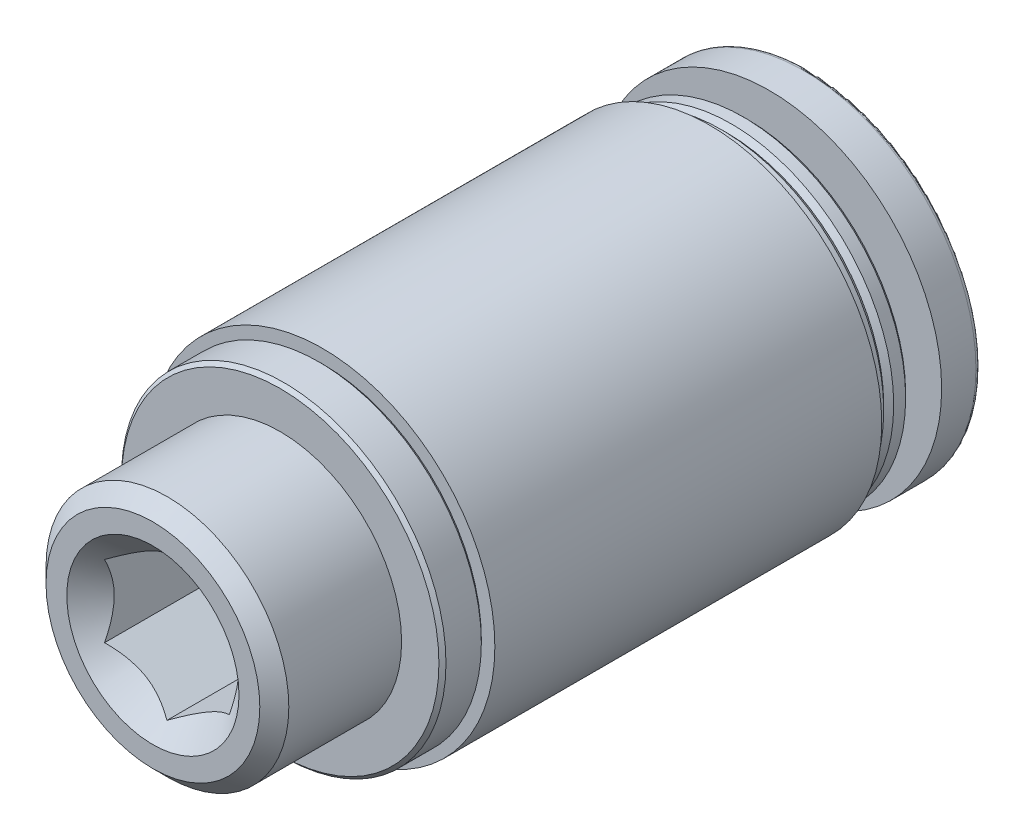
ISO-10303-21;
HEADER;
FILE_DESCRIPTION(('STEP AP214'),'2;1');
FILE_NAME('part.step','',(''),(''),'','','');
FILE_SCHEMA(('AUTOMOTIVE_DESIGN { 1 0 10303 214 1 1 1 1 }'));
ENDSEC;
DATA;
#1=APPLICATION_CONTEXT('core data for automotive mechanical design processes');
#2=APPLICATION_PROTOCOL_DEFINITION('international standard','automotive_design',2000,#1);
#3=PRODUCT_CONTEXT('',#1,'mechanical');
#4=PRODUCT('Part','Part','',(#3));
#5=PRODUCT_RELATED_PRODUCT_CATEGORY('part','',(#4));
#6=PRODUCT_DEFINITION_FORMATION('','',#4);
#7=PRODUCT_DEFINITION_CONTEXT('part definition',#1,'design');
#8=PRODUCT_DEFINITION('design','',#6,#7);
#9=PRODUCT_DEFINITION_SHAPE('','',#8);
#10=(LENGTH_UNIT() NAMED_UNIT(*) SI_UNIT(.MILLI.,.METRE.));
#11=(NAMED_UNIT(*) PLANE_ANGLE_UNIT() SI_UNIT($,.RADIAN.));
#12=(NAMED_UNIT(*) SI_UNIT($,.STERADIAN.) SOLID_ANGLE_UNIT());
#13=UNCERTAINTY_MEASURE_WITH_UNIT(LENGTH_MEASURE(1.E-05),#10,'distance_accuracy_value','');
#14=(GEOMETRIC_REPRESENTATION_CONTEXT(3) GLOBAL_UNCERTAINTY_ASSIGNED_CONTEXT((#13)) GLOBAL_UNIT_ASSIGNED_CONTEXT((#10,
#11,#12)) REPRESENTATION_CONTEXT('',''));
#15=CARTESIAN_POINT('',(0.,0.,0.));
#16=DIRECTION('',(0.,0.,1.));
#17=DIRECTION('',(1.,0.,0.));
#18=AXIS2_PLACEMENT_3D('',#15,#16,#17);
#19=CARTESIAN_POINT('',(0.,0.,5.1));
#20=DIRECTION('',(0.,0.,-1.));
#21=DIRECTION('',(-1.,0.,0.));
#22=AXIS2_PLACEMENT_3D('',#19,#20,#21);
#23=PLANE('',#22);
#24=CARTESIAN_POINT('',(0.,0.,5.1));
#25=DIRECTION('',(0.,0.,1.));
#26=DIRECTION('',(1.,0.,0.));
#27=AXIS2_PLACEMENT_3D('',#24,#25,#26);
#28=CIRCLE('',#27,4.283);
#29=CARTESIAN_POINT('',(4.283,0.,5.1));
#30=VERTEX_POINT('',#29);
#31=EDGE_CURVE('E155',#30,#30,#28,.T.);
#32=ORIENTED_EDGE('',*,*,#31,.T.);
#33=EDGE_LOOP('',(#32));
#34=FACE_BOUND('',#33,.T.);
#35=CARTESIAN_POINT('',(0.,0.,5.1));
#36=DIRECTION('',(0.,0.,1.));
#37=DIRECTION('',(1.,0.,0.));
#38=AXIS2_PLACEMENT_3D('',#35,#36,#37);
#39=CIRCLE('',#38,3.45);
#40=CARTESIAN_POINT('',(3.45,0.,5.1));
#41=VERTEX_POINT('',#40);
#42=EDGE_CURVE('E118',#41,#41,#39,.T.);
#43=ORIENTED_EDGE('',*,*,#42,.F.);
#44=EDGE_LOOP('',(#43));
#45=FACE_BOUND('',#44,.T.);
#46=ADVANCED_FACE('F31',(#34,#45),#23,.F.);
#47=CARTESIAN_POINT('',(0.,0.,-1.7));
#48=DIRECTION('',(0.,0.,-1.));
#49=DIRECTION('',(-1.,0.,0.));
#50=AXIS2_PLACEMENT_3D('',#47,#48,#49);
#51=PLANE('',#50);
#52=CARTESIAN_POINT('',(0.,0.,-1.7));
#53=DIRECTION('',(0.,0.,1.));
#54=DIRECTION('',(1.,0.,0.));
#55=AXIS2_PLACEMENT_3D('',#52,#53,#54);
#56=CIRCLE('',#55,6.9);
#57=CARTESIAN_POINT('',(6.9,0.,-1.7));
#58=VERTEX_POINT('',#57);
#59=EDGE_CURVE('E158',#58,#58,#56,.T.);
#60=ORIENTED_EDGE('',*,*,#59,.T.);
#61=EDGE_LOOP('',(#60));
#62=FACE_BOUND('',#61,.T.);
#63=CARTESIAN_POINT('',(0.,0.,-1.7));
#64=DIRECTION('',(0.,0.,-1.));
#65=DIRECTION('',(-1.,0.,0.));
#66=AXIS2_PLACEMENT_3D('',#63,#64,#65);
#67=CIRCLE('',#66,6.3585786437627);
#68=CARTESIAN_POINT('',(-6.3585786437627,0.,-1.7));
#69=VERTEX_POINT('',#68);
#70=EDGE_CURVE('E200',#69,#69,#67,.F.);
#71=ORIENTED_EDGE('',*,*,#70,.F.);
#72=EDGE_LOOP('',(#71));
#73=FACE_BOUND('',#72,.T.);
#74=ADVANCED_FACE('F262',(#62,#73),#51,.F.);
#75=CARTESIAN_POINT('',(0.,0.,-21.6));
#76=DIRECTION('',(0.,0.,1.));
#77=DIRECTION('',(1.,0.,0.));
#78=AXIS2_PLACEMENT_3D('',#75,#76,#77);
#79=CONICAL_SURFACE('',#78,4.3,1.39626340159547);
#80=CARTESIAN_POINT('',(0.,0.,-21.170691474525));
#81=DIRECTION('',(0.,0.,1.));
#82=DIRECTION('',(1.,0.,0.));
#83=AXIS2_PLACEMENT_3D('',#80,#81,#82);
#84=CIRCLE('',#83,6.7347296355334);
#85=CARTESIAN_POINT('',(6.7347296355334,0.,-21.170691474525));
#86=VERTEX_POINT('',#85);
#87=EDGE_CURVE('E197',#86,#86,#84,.T.);
#88=ORIENTED_EDGE('',*,*,#87,.F.);
#89=EDGE_LOOP('',(#88));
#90=FACE_BOUND('',#89,.T.);
#91=CARTESIAN_POINT('',(0.,0.,-21.6));
#92=DIRECTION('',(0.,0.,1.));
#93=DIRECTION('',(1.,0.,0.));
#94=AXIS2_PLACEMENT_3D('',#91,#92,#93);
#95=CIRCLE('',#94,4.3);
#96=CARTESIAN_POINT('',(4.3,0.,-21.6));
#97=VERTEX_POINT('',#96);
#98=EDGE_CURVE('E137',#97,#97,#95,.T.);
#99=ORIENTED_EDGE('',*,*,#98,.T.);
#100=EDGE_LOOP('',(#99));
#101=FACE_BOUND('',#100,.T.);
#102=ADVANCED_FACE('F33',(#90,#101),#79,.T.);
#103=CARTESIAN_POINT('',(0.,0.,-20.9737299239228));
#104=DIRECTION('',(0.,0.,1.));
#105=DIRECTION('',(1.,0.,0.));
#106=AXIS2_PLACEMENT_3D('',#103,#104,#105);
#107=TOROIDAL_SURFACE('',#106,6.70000000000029,0.199999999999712);
#108=CARTESIAN_POINT('',(0.,0.,-20.973729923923));
#109=DIRECTION('',(0.,0.,1.));
#110=DIRECTION('',(1.,0.,0.));
#111=AXIS2_PLACEMENT_3D('',#108,#109,#110);
#112=CIRCLE('',#111,6.9);
#113=CARTESIAN_POINT('',(6.9,0.,-20.973729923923));
#114=VERTEX_POINT('',#113);
#115=EDGE_CURVE('E194',#114,#114,#112,.T.);
#116=ORIENTED_EDGE('',*,*,#115,.F.);
#117=EDGE_LOOP('',(#116));
#118=FACE_BOUND('',#117,.T.);
#119=ORIENTED_EDGE('',*,*,#87,.T.);
#120=EDGE_LOOP('',(#119));
#121=FACE_BOUND('',#120,.T.);
#122=ADVANCED_FACE('F321',(#118,#121),#107,.T.);
#123=CARTESIAN_POINT('',(0.,0.,-21.6));
#124=DIRECTION('',(0.,0.,1.));
#125=DIRECTION('',(1.,0.,0.));
#126=AXIS2_PLACEMENT_3D('',#123,#124,#125);
#127=CYLINDRICAL_SURFACE('',#126,6.9);
#128=CARTESIAN_POINT('',(0.,0.,-19.6));
#129=DIRECTION('',(0.,0.,1.));
#130=DIRECTION('',(1.,0.,0.));
#131=AXIS2_PLACEMENT_3D('',#128,#129,#130);
#132=CIRCLE('',#131,6.9);
#133=CARTESIAN_POINT('',(6.9,0.,-19.6));
#134=VERTEX_POINT('',#133);
#135=EDGE_CURVE('E191',#134,#134,#132,.T.);
#136=ORIENTED_EDGE('',*,*,#135,.F.);
#137=EDGE_LOOP('',(#136));
#138=FACE_BOUND('',#137,.T.);
#139=ORIENTED_EDGE('',*,*,#115,.T.);
#140=EDGE_LOOP('',(#139));
#141=FACE_BOUND('',#140,.T.);
#142=ADVANCED_FACE('F318',(#138,#141),#127,.T.);
#143=CARTESIAN_POINT('',(0.,5.075,-19.6));
#144=DIRECTION('',(0.,0.,-1.));
#145=DIRECTION('',(-1.,0.,0.));
#146=AXIS2_PLACEMENT_3D('',#143,#144,#145);
#147=PLANE('',#146);
#148=CARTESIAN_POINT('',(0.,0.,-19.6));
#149=DIRECTION('',(0.,0.,1.));
#150=DIRECTION('',(1.,0.,0.));
#151=AXIS2_PLACEMENT_3D('',#148,#149,#150);
#152=CIRCLE('',#151,5.075);
#153=CARTESIAN_POINT('',(5.075,0.,-19.6));
#154=VERTEX_POINT('',#153);
#155=EDGE_CURVE('E188',#154,#154,#152,.T.);
#156=ORIENTED_EDGE('',*,*,#155,.F.);
#157=EDGE_LOOP('',(#156));
#158=FACE_BOUND('',#157,.T.);
#159=ORIENTED_EDGE('',*,*,#135,.T.);
#160=EDGE_LOOP('',(#159));
#161=FACE_BOUND('',#160,.T.);
#162=ADVANCED_FACE('F314',(#158,#161),#147,.F.);
#163=CARTESIAN_POINT('',(0.,0.,-19.2250000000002));
#164=DIRECTION('',(0.,0.,1.));
#165=DIRECTION('',(1.,0.,0.));
#166=AXIS2_PLACEMENT_3D('',#163,#164,#165);
#167=TOROIDAL_SURFACE('',#166,5.07499999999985,0.37499999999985);
#168=CARTESIAN_POINT('',(0.,0.,-19.225));
#169=DIRECTION('',(0.,0.,1.));
#170=DIRECTION('',(1.,0.,0.));
#171=AXIS2_PLACEMENT_3D('',#168,#169,#170);
#172=CIRCLE('',#171,4.7);
#173=CARTESIAN_POINT('',(4.7,0.,-19.225));
#174=VERTEX_POINT('',#173);
#175=EDGE_CURVE('E185',#174,#174,#172,.T.);
#176=ORIENTED_EDGE('',*,*,#175,.F.);
#177=EDGE_LOOP('',(#176));
#178=FACE_BOUND('',#177,.T.);
#179=ORIENTED_EDGE('',*,*,#155,.T.);
#180=EDGE_LOOP('',(#179));
#181=FACE_BOUND('',#180,.T.);
#182=ADVANCED_FACE('F310',(#178,#181),#167,.F.);
#183=CARTESIAN_POINT('',(0.,0.,-21.6));
#184=DIRECTION('',(0.,0.,1.));
#185=DIRECTION('',(1.,0.,0.));
#186=AXIS2_PLACEMENT_3D('',#183,#184,#185);
#187=CYLINDRICAL_SURFACE('',#186,4.7);
#188=CARTESIAN_POINT('',(0.,0.,-18.7));
#189=DIRECTION('',(0.,0.,1.));
#190=DIRECTION('',(1.,0.,0.));
#191=AXIS2_PLACEMENT_3D('',#188,#189,#190);
#192=CIRCLE('',#191,4.7);
#193=CARTESIAN_POINT('',(4.7,0.,-18.7));
#194=VERTEX_POINT('',#193);
#195=EDGE_CURVE('E182',#194,#194,#192,.T.);
#196=ORIENTED_EDGE('',*,*,#195,.F.);
#197=EDGE_LOOP('',(#196));
#198=FACE_BOUND('',#197,.T.);
#199=ORIENTED_EDGE('',*,*,#175,.T.);
#200=EDGE_LOOP('',(#199));
#201=FACE_BOUND('',#200,.T.);
#202=ADVANCED_FACE('F306',(#198,#201),#187,.T.);
#203=CARTESIAN_POINT('',(0.,6.3585786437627,-18.7));
#204=DIRECTION('',(0.,0.,1.));
#205=DIRECTION('',(1.,0.,0.));
#206=AXIS2_PLACEMENT_3D('',#203,#204,#205);
#207=PLANE('',#206);
#208=CARTESIAN_POINT('',(0.,0.,-18.7));
#209=DIRECTION('',(0.,0.,1.));
#210=DIRECTION('',(1.,0.,0.));
#211=AXIS2_PLACEMENT_3D('',#208,#209,#210);
#212=CIRCLE('',#211,6.3585786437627);
#213=CARTESIAN_POINT('',(6.3585786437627,0.,-18.7));
#214=VERTEX_POINT('',#213);
#215=EDGE_CURVE('E179',#214,#214,#212,.T.);
#216=ORIENTED_EDGE('',*,*,#215,.F.);
#217=EDGE_LOOP('',(#216));
#218=FACE_BOUND('',#217,.T.);
#219=ORIENTED_EDGE('',*,*,#195,.T.);
#220=EDGE_LOOP('',(#219));
#221=FACE_BOUND('',#220,.T.);
#222=ADVANCED_FACE('F302',(#218,#221),#207,.F.);
#223=CARTESIAN_POINT('',(0.,0.,-18.7));
#224=DIRECTION('',(0.,0.,1.));
#225=DIRECTION('',(1.,0.,0.));
#226=AXIS2_PLACEMENT_3D('',#223,#224,#225);
#227=CONICAL_SURFACE('',#226,6.3585786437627,0.785398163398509);
#228=CARTESIAN_POINT('',(0.,0.,-18.558578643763));
#229=DIRECTION('',(0.,0.,1.));
#230=DIRECTION('',(1.,0.,0.));
#231=AXIS2_PLACEMENT_3D('',#228,#229,#230);
#232=CIRCLE('',#231,6.5);
#233=CARTESIAN_POINT('',(6.5,0.,-18.558578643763));
#234=VERTEX_POINT('',#233);
#235=EDGE_CURVE('E176',#234,#234,#232,.T.);
#236=ORIENTED_EDGE('',*,*,#235,.F.);
#237=EDGE_LOOP('',(#236));
#238=FACE_BOUND('',#237,.T.);
#239=ORIENTED_EDGE('',*,*,#215,.T.);
#240=EDGE_LOOP('',(#239));
#241=FACE_BOUND('',#240,.T.);
#242=ADVANCED_FACE('F298',(#238,#241),#227,.T.);
#243=CARTESIAN_POINT('',(0.,0.,-21.6));
#244=DIRECTION('',(0.,0.,1.));
#245=DIRECTION('',(1.,0.,0.));
#246=AXIS2_PLACEMENT_3D('',#243,#244,#245);
#247=CYLINDRICAL_SURFACE('',#246,6.5);
#248=CARTESIAN_POINT('',(0.,0.,-18.079289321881));
#249=DIRECTION('',(0.,0.,1.));
#250=DIRECTION('',(1.,0.,0.));
#251=AXIS2_PLACEMENT_3D('',#248,#249,#250);
#252=CIRCLE('',#251,6.5);
#253=CARTESIAN_POINT('',(6.5,0.,-18.079289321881));
#254=VERTEX_POINT('',#253);
#255=EDGE_CURVE('E173',#254,#254,#252,.T.);
#256=ORIENTED_EDGE('',*,*,#255,.F.);
#257=EDGE_LOOP('',(#256));
#258=FACE_BOUND('',#257,.T.);
#259=ORIENTED_EDGE('',*,*,#235,.T.);
#260=EDGE_LOOP('',(#259));
#261=FACE_BOUND('',#260,.T.);
#262=ADVANCED_FACE('F294',(#258,#261),#247,.T.);
#263=CARTESIAN_POINT('',(0.,0.,-18.079289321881));
#264=DIRECTION('',(0.,0.,-1.));
#265=DIRECTION('',(-1.,0.,0.));
#266=AXIS2_PLACEMENT_3D('',#263,#264,#265);
#267=CONICAL_SURFACE('',#266,6.5,0.785398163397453);
#268=CARTESIAN_POINT('',(0.,0.,-17.879289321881));
#269=DIRECTION('',(0.,0.,1.));
#270=DIRECTION('',(1.,0.,0.));
#271=AXIS2_PLACEMENT_3D('',#268,#269,#270);
#272=CIRCLE('',#271,6.3);
#273=CARTESIAN_POINT('',(6.3,0.,-17.879289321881));
#274=VERTEX_POINT('',#273);
#275=EDGE_CURVE('E170',#274,#274,#272,.T.);
#276=ORIENTED_EDGE('',*,*,#275,.F.);
#277=EDGE_LOOP('',(#276));
#278=FACE_BOUND('',#277,.T.);
#279=ORIENTED_EDGE('',*,*,#255,.T.);
#280=EDGE_LOOP('',(#279));
#281=FACE_BOUND('',#280,.T.);
#282=ADVANCED_FACE('F290',(#278,#281),#267,.T.);
#283=CARTESIAN_POINT('',(0.,0.,-17.879289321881));
#284=DIRECTION('',(0.,0.,1.));
#285=DIRECTION('',(1.,0.,0.));
#286=AXIS2_PLACEMENT_3D('',#283,#284,#285);
#287=CONICAL_SURFACE('',#286,6.3,0.785398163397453);
#288=CARTESIAN_POINT('',(0.,0.,-17.679289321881));
#289=DIRECTION('',(0.,0.,1.));
#290=DIRECTION('',(1.,0.,0.));
#291=AXIS2_PLACEMENT_3D('',#288,#289,#290);
#292=CIRCLE('',#291,6.5);
#293=CARTESIAN_POINT('',(6.5,0.,-17.679289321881));
#294=VERTEX_POINT('',#293);
#295=EDGE_CURVE('E167',#294,#294,#292,.T.);
#296=ORIENTED_EDGE('',*,*,#295,.F.);
#297=EDGE_LOOP('',(#296));
#298=FACE_BOUND('',#297,.T.);
#299=ORIENTED_EDGE('',*,*,#275,.T.);
#300=EDGE_LOOP('',(#299));
#301=FACE_BOUND('',#300,.T.);
#302=ADVANCED_FACE('F286',(#298,#301),#287,.T.);
#303=CARTESIAN_POINT('',(0.,0.,-21.6));
#304=DIRECTION('',(0.,0.,1.));
#305=DIRECTION('',(1.,0.,0.));
#306=AXIS2_PLACEMENT_3D('',#303,#304,#305);
#307=CYLINDRICAL_SURFACE('',#306,6.5);
#308=CARTESIAN_POINT('',(0.,0.,-17.2));
#309=DIRECTION('',(0.,0.,1.));
#310=DIRECTION('',(1.,0.,0.));
#311=AXIS2_PLACEMENT_3D('',#308,#309,#310);
#312=CIRCLE('',#311,6.5);
#313=CARTESIAN_POINT('',(6.5,0.,-17.2));
#314=VERTEX_POINT('',#313);
#315=EDGE_CURVE('E164',#314,#314,#312,.T.);
#316=ORIENTED_EDGE('',*,*,#315,.F.);
#317=EDGE_LOOP('',(#316));
#318=FACE_BOUND('',#317,.T.);
#319=ORIENTED_EDGE('',*,*,#295,.T.);
#320=EDGE_LOOP('',(#319));
#321=FACE_BOUND('',#320,.T.);
#322=ADVANCED_FACE('F282',(#318,#321),#307,.T.);
#323=CARTESIAN_POINT('',(0.,6.9,-17.2));
#324=DIRECTION('',(0.,0.,1.));
#325=DIRECTION('',(1.,0.,0.));
#326=AXIS2_PLACEMENT_3D('',#323,#324,#325);
#327=PLANE('',#326);
#328=CARTESIAN_POINT('',(0.,0.,-17.2));
#329=DIRECTION('',(0.,0.,1.));
#330=DIRECTION('',(1.,0.,0.));
#331=AXIS2_PLACEMENT_3D('',#328,#329,#330);
#332=CIRCLE('',#331,6.9);
#333=CARTESIAN_POINT('',(6.9,0.,-17.2));
#334=VERTEX_POINT('',#333);
#335=EDGE_CURVE('E161',#334,#334,#332,.T.);
#336=ORIENTED_EDGE('',*,*,#335,.F.);
#337=EDGE_LOOP('',(#336));
#338=FACE_BOUND('',#337,.T.);
#339=ORIENTED_EDGE('',*,*,#315,.T.);
#340=EDGE_LOOP('',(#339));
#341=FACE_BOUND('',#340,.T.);
#342=ADVANCED_FACE('F278',(#338,#341),#327,.F.);
#343=CARTESIAN_POINT('',(0.,0.,-21.6));
#344=DIRECTION('',(0.,0.,1.));
#345=DIRECTION('',(1.,0.,0.));
#346=AXIS2_PLACEMENT_3D('',#343,#344,#345);
#347=CYLINDRICAL_SURFACE('',#346,6.9);
#348=ORIENTED_EDGE('',*,*,#59,.F.);
#349=EDGE_LOOP('',(#348));
#350=FACE_BOUND('',#349,.T.);
#351=ORIENTED_EDGE('',*,*,#335,.T.);
#352=EDGE_LOOP('',(#351));
#353=FACE_BOUND('',#352,.T.);
#354=ADVANCED_FACE('F275',(#350,#353),#347,.T.);
#355=CARTESIAN_POINT('',(0.,0.,4.519));
#356=DIRECTION('',(0.,0.,-1.));
#357=DIRECTION('',(-1.,0.,0.));
#358=AXIS2_PLACEMENT_3D('',#355,#356,#357);
#359=CONICAL_SURFACE('',#358,4.864,0.785398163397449);
#360=ORIENTED_EDGE('',*,*,#31,.F.);
#361=EDGE_LOOP('',(#360));
#362=FACE_BOUND('',#361,.T.);
#363=CARTESIAN_POINT('',(0.,0.,4.519));
#364=DIRECTION('',(0.,0.,1.));
#365=DIRECTION('',(1.,0.,0.));
#366=AXIS2_PLACEMENT_3D('',#363,#364,#365);
#367=CIRCLE('',#366,4.864);
#368=CARTESIAN_POINT('',(4.864,0.,4.519));
#369=VERTEX_POINT('',#368);
#370=EDGE_CURVE('E152',#369,#369,#367,.T.);
#371=ORIENTED_EDGE('',*,*,#370,.T.);
#372=EDGE_LOOP('',(#371));
#373=FACE_BOUND('',#372,.T.);
#374=ADVANCED_FACE('F272',(#362,#373),#359,.T.);
#375=CARTESIAN_POINT('',(0.,0.,-1.7));
#376=DIRECTION('',(0.,0.,1.));
#377=DIRECTION('',(1.,0.,0.));
#378=AXIS2_PLACEMENT_3D('',#375,#376,#377);
#379=CYLINDRICAL_SURFACE('',#378,4.864);
#380=ORIENTED_EDGE('',*,*,#370,.F.);
#381=EDGE_LOOP('',(#380));
#382=FACE_BOUND('',#381,.T.);
#383=CARTESIAN_POINT('',(0.,0.,0.));
#384=DIRECTION('',(0.,0.,1.));
#385=DIRECTION('',(1.,0.,0.));
#386=AXIS2_PLACEMENT_3D('',#383,#384,#385);
#387=CIRCLE('',#386,4.864);
#388=CARTESIAN_POINT('',(4.864,0.,0.));
#389=VERTEX_POINT('',#388);
#390=EDGE_CURVE('E149',#389,#389,#387,.T.);
#391=ORIENTED_EDGE('',*,*,#390,.T.);
#392=EDGE_LOOP('',(#391));
#393=FACE_BOUND('',#392,.T.);
#394=ADVANCED_FACE('F359',(#382,#393),#379,.T.);
#395=CARTESIAN_POINT('',(0.,4.864,0.));
#396=DIRECTION('',(0.,0.,-1.));
#397=DIRECTION('',(-1.,0.,0.));
#398=AXIS2_PLACEMENT_3D('',#395,#396,#397);
#399=PLANE('',#398);
#400=ORIENTED_EDGE('',*,*,#390,.F.);
#401=EDGE_LOOP('',(#400));
#402=FACE_BOUND('',#401,.T.);
#403=CARTESIAN_POINT('',(0.,0.,0.));
#404=DIRECTION('',(0.,0.,1.));
#405=DIRECTION('',(1.,0.,0.));
#406=AXIS2_PLACEMENT_3D('',#403,#404,#405);
#407=CIRCLE('',#406,6.3585786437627);
#408=CARTESIAN_POINT('',(6.3585786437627,0.,0.));
#409=VERTEX_POINT('',#408);
#410=EDGE_CURVE('E146',#409,#409,#407,.T.);
#411=ORIENTED_EDGE('',*,*,#410,.T.);
#412=EDGE_LOOP('',(#411));
#413=FACE_BOUND('',#412,.T.);
#414=ADVANCED_FACE('F356',(#402,#413),#399,.F.);
#415=CARTESIAN_POINT('',(0.,0.,-0.14142135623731));
#416=DIRECTION('',(0.,0.,-1.));
#417=DIRECTION('',(-1.,0.,0.));
#418=AXIS2_PLACEMENT_3D('',#415,#416,#417);
#419=CONICAL_SURFACE('',#418,6.5,0.785398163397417);
#420=ORIENTED_EDGE('',*,*,#410,.F.);
#421=EDGE_LOOP('',(#420));
#422=FACE_BOUND('',#421,.T.);
#423=CARTESIAN_POINT('',(0.,0.,-0.14142135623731));
#424=DIRECTION('',(0.,0.,1.));
#425=DIRECTION('',(1.,0.,0.));
#426=AXIS2_PLACEMENT_3D('',#423,#424,#425);
#427=CIRCLE('',#426,6.5);
#428=CARTESIAN_POINT('',(6.5,0.,-0.14142135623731));
#429=VERTEX_POINT('',#428);
#430=EDGE_CURVE('E143',#429,#429,#427,.T.);
#431=ORIENTED_EDGE('',*,*,#430,.T.);
#432=EDGE_LOOP('',(#431));
#433=FACE_BOUND('',#432,.T.);
#434=ADVANCED_FACE('F352',(#422,#433),#419,.T.);
#435=CARTESIAN_POINT('',(0.,0.,-1.7));
#436=DIRECTION('',(0.,0.,1.));
#437=DIRECTION('',(1.,0.,0.));
#438=AXIS2_PLACEMENT_3D('',#435,#436,#437);
#439=CYLINDRICAL_SURFACE('',#438,6.5);
#440=ORIENTED_EDGE('',*,*,#430,.F.);
#441=EDGE_LOOP('',(#440));
#442=FACE_BOUND('',#441,.T.);
#443=CARTESIAN_POINT('',(0.,0.,-1.5585786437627));
#444=DIRECTION('',(0.,0.,1.));
#445=DIRECTION('',(1.,0.,0.));
#446=AXIS2_PLACEMENT_3D('',#443,#444,#445);
#447=CIRCLE('',#446,6.5);
#448=CARTESIAN_POINT('',(6.5,0.,-1.5585786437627));
#449=VERTEX_POINT('',#448);
#450=EDGE_CURVE('E140',#449,#449,#447,.T.);
#451=ORIENTED_EDGE('',*,*,#450,.T.);
#452=EDGE_LOOP('',(#451));
#453=FACE_BOUND('',#452,.T.);
#454=ADVANCED_FACE('F346',(#442,#453),#439,.T.);
#455=CARTESIAN_POINT('',(0.,0.,-1.7));
#456=DIRECTION('',(0.,0.,1.));
#457=DIRECTION('',(1.,0.,0.));
#458=AXIS2_PLACEMENT_3D('',#455,#456,#457);
#459=CONICAL_SURFACE('',#458,6.3585786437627,0.785398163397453);
#460=ORIENTED_EDGE('',*,*,#450,.F.);
#461=EDGE_LOOP('',(#460));
#462=FACE_BOUND('',#461,.T.);
#463=ORIENTED_EDGE('',*,*,#70,.T.);
#464=EDGE_LOOP('',(#463));
#465=FACE_BOUND('',#464,.T.);
#466=ADVANCED_FACE('F338',(#462,#465),#459,.T.);
#467=CARTESIAN_POINT('',(0.,0.,-21.3000000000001));
#468=DIRECTION('',(0.,0.,1.));
#469=DIRECTION('',(1.,0.,0.));
#470=AXIS2_PLACEMENT_3D('',#467,#468,#469);
#471=TOROIDAL_SURFACE('',#470,4.29999999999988,0.29999999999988);
#472=CARTESIAN_POINT('',(0.,0.,-21.3));
#473=DIRECTION('',(0.,0.,1.));
#474=DIRECTION('',(1.,0.,0.));
#475=AXIS2_PLACEMENT_3D('',#472,#473,#474);
#476=CIRCLE('',#475,4.);
#477=CARTESIAN_POINT('',(4.,0.,-21.3));
#478=VERTEX_POINT('',#477);
#479=EDGE_CURVE('E134',#478,#478,#476,.T.);
#480=ORIENTED_EDGE('',*,*,#479,.T.);
#481=EDGE_LOOP('',(#480));
#482=FACE_BOUND('',#481,.T.);
#483=ORIENTED_EDGE('',*,*,#98,.F.);
#484=EDGE_LOOP('',(#483));
#485=FACE_BOUND('',#484,.T.);
#486=ADVANCED_FACE('F335',(#482,#485),#471,.T.);
#487=CARTESIAN_POINT('',(0.,0.,-21.6));
#488=DIRECTION('',(0.,0.,1.));
#489=DIRECTION('',(1.,0.,0.));
#490=AXIS2_PLACEMENT_3D('',#487,#488,#489);
#491=CYLINDRICAL_SURFACE('',#490,4.);
#492=CARTESIAN_POINT('',(0.,0.,-3.4));
#493=DIRECTION('',(0.,0.,1.));
#494=DIRECTION('',(1.,0.,0.));
#495=AXIS2_PLACEMENT_3D('',#492,#493,#494);
#496=CIRCLE('',#495,4.);
#497=CARTESIAN_POINT('',(4.,0.,-3.4));
#498=VERTEX_POINT('',#497);
#499=EDGE_CURVE('E131',#498,#498,#496,.T.);
#500=ORIENTED_EDGE('',*,*,#499,.T.);
#501=EDGE_LOOP('',(#500));
#502=FACE_BOUND('',#501,.T.);
#503=ORIENTED_EDGE('',*,*,#479,.F.);
#504=EDGE_LOOP('',(#503));
#505=FACE_BOUND('',#504,.T.);
#506=ADVANCED_FACE('F337',(#502,#505),#491,.F.);
#507=CARTESIAN_POINT('',(0.,2.35,-3.4));
#508=DIRECTION('',(0.,0.,-1.));
#509=DIRECTION('',(-1.,0.,0.));
#510=AXIS2_PLACEMENT_3D('',#507,#508,#509);
#511=PLANE('',#510);
#512=DIRECTION('',(-0.866025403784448,-0.499999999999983,0.));
#513=VECTOR('',#512,1.);
#514=CARTESIAN_POINT('',(0.,2.8867513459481,-3.4));
#515=LINE('',#514,#513);
#516=CARTESIAN_POINT('',(0.,2.8867513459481,-3.4));
#517=VERTEX_POINT('',#516);
#518=CARTESIAN_POINT('',(-2.5,1.4433756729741,-3.4));
#519=VERTEX_POINT('',#518);
#520=EDGE_CURVE('E91',#517,#519,#515,.T.);
#521=ORIENTED_EDGE('',*,*,#520,.T.);
#522=DIRECTION('',(0.,-1.,0.));
#523=VECTOR('',#522,1.);
#524=CARTESIAN_POINT('',(-2.5,1.4433756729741,-3.4));
#525=LINE('',#524,#523);
#526=CARTESIAN_POINT('',(-2.5,-1.4433756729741,-3.4));
#527=VERTEX_POINT('',#526);
#528=EDGE_CURVE('E99',#519,#527,#525,.T.);
#529=ORIENTED_EDGE('',*,*,#528,.T.);
#530=DIRECTION('',(0.866025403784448,-0.499999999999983,0.));
#531=VECTOR('',#530,1.);
#532=CARTESIAN_POINT('',(-2.5,-1.4433756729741,-3.4));
#533=LINE('',#532,#531);
#534=CARTESIAN_POINT('',(0.,-2.8867513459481,-3.4));
#535=VERTEX_POINT('',#534);
#536=EDGE_CURVE('E51',#527,#535,#533,.T.);
#537=ORIENTED_EDGE('',*,*,#536,.T.);
#538=DIRECTION('',(0.866025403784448,0.499999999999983,0.));
#539=VECTOR('',#538,1.);
#540=CARTESIAN_POINT('',(0.,-2.8867513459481,-3.4));
#541=LINE('',#540,#539);
#542=CARTESIAN_POINT('',(2.5,-1.4433756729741,-3.4));
#543=VERTEX_POINT('',#542);
#544=EDGE_CURVE('E110',#535,#543,#541,.T.);
#545=ORIENTED_EDGE('',*,*,#544,.T.);
#546=DIRECTION('',(0.,1.,0.));
#547=VECTOR('',#546,1.);
#548=CARTESIAN_POINT('',(2.5,-1.4433756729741,-3.4));
#549=LINE('',#548,#547);
#550=CARTESIAN_POINT('',(2.5,1.4433756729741,-3.4));
#551=VERTEX_POINT('',#550);
#552=EDGE_CURVE('E113',#543,#551,#549,.T.);
#553=ORIENTED_EDGE('',*,*,#552,.T.);
#554=DIRECTION('',(-0.866025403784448,0.499999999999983,0.));
#555=VECTOR('',#554,1.);
#556=CARTESIAN_POINT('',(2.5,1.4433756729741,-3.4));
#557=LINE('',#556,#555);
#558=EDGE_CURVE('E96',#551,#517,#557,.T.);
#559=ORIENTED_EDGE('',*,*,#558,.T.);
#560=EDGE_LOOP('',(#521,#529,#537,#545,#553,#559));
#561=FACE_BOUND('',#560,.T.);
#562=ORIENTED_EDGE('',*,*,#499,.F.);
#563=EDGE_LOOP('',(#562));
#564=FACE_BOUND('',#563,.T.);
#565=ADVANCED_FACE('F103',(#561,#564),#511,.T.);
#566=CARTESIAN_POINT('',(0.,0.,4.));
#567=DIRECTION('',(0.,0.,1.));
#568=DIRECTION('',(1.,0.,0.));
#569=AXIS2_PLACEMENT_3D('',#566,#567,#568);
#570=CONICAL_SURFACE('',#569,2.35,0.785398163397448);
#571=CARTESIAN_POINT('',(0.0002,2.88686681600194,4.53686682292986));
#572=CARTESIAN_POINT('',(-0.0857382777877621,2.83725032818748,4.48729205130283));
#573=CARTESIAN_POINT('',(-0.173113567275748,2.78680418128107,4.44062882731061));
#574=CARTESIAN_POINT('',(-0.351281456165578,2.68393890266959,4.35518948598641));
#575=CARTESIAN_POINT('',(-0.442091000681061,2.63150998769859,4.31646090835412));
#576=CARTESIAN_POINT('',(-0.625204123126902,2.52578957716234,4.25011804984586));
#577=CARTESIAN_POINT('',(-0.717461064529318,2.47252500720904,4.22233701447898));
#578=CARTESIAN_POINT('',(-0.904006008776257,2.36482323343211,4.17953452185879));
#579=CARTESIAN_POINT('',(-0.998288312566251,2.31038931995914,4.16448111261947));
#580=CARTESIAN_POINT('',(-1.16077825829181,2.21657570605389,4.15089906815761));
#581=CARTESIAN_POINT('',(-1.22877596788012,2.1773172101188,4.14888844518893));
#582=CARTESIAN_POINT('',(-1.36466024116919,2.09886438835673,4.15227546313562));
#583=CARTESIAN_POINT('',(-1.4325467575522,2.05967008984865,4.15767570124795));
#584=CARTESIAN_POINT('',(-1.56767878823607,1.98165157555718,4.1755771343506));
#585=CARTESIAN_POINT('',(-1.63492349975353,1.942827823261,4.18808627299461));
#586=CARTESIAN_POINT('',(-1.76825010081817,1.86585167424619,4.21951884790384));
#587=CARTESIAN_POINT('',(-1.83433207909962,1.82769922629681,4.23844179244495));
#588=CARTESIAN_POINT('',(-2.00359634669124,1.72997445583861,4.29461870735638));
#589=CARTESIAN_POINT('',(-2.10572912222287,1.67100807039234,4.33610717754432));
#590=CARTESIAN_POINT('',(-2.2559064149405,1.58430317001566,4.40614539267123));
#591=CARTESIAN_POINT('',(-2.3053965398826,1.55573003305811,4.43075359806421));
#592=CARTESIAN_POINT('',(-2.40346006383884,1.49911303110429,4.48221323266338));
#593=CARTESIAN_POINT('',(-2.45203400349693,1.4710688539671,4.5090632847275));
#594=CARTESIAN_POINT('',(-2.5002,1.44326020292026,4.53686682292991));
#595=B_SPLINE_CURVE_WITH_KNOTS('',3,(#571,#572,#573,#574,#575,#576,#577,#578,#579,#580,#581,
#582,#583,#584,#585,#586,#587,#588,#589,#590,#591,#592,#593,#594),.UNSPECIFIED.,.F.,.F.,(4,2,2,
2,2,2,2,2,2,2,2,4),(0.,0.333012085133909,0.667964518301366,0.997597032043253,1.32639954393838,
1.56169424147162,1.79707142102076,2.03271213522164,2.26833478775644,2.64260240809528,
2.82922877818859,3.01574133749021),.UNSPECIFIED.);
#596=CARTESIAN_POINT('',(0.,2.8867513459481,4.5367513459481));
#597=VERTEX_POINT('',#596);
#598=CARTESIAN_POINT('',(-2.5,1.4433756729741,4.53675134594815));
#599=VERTEX_POINT('',#598);
#600=EDGE_CURVE('E11',#597,#599,#595,.T.);
#601=ORIENTED_EDGE('',*,*,#600,.F.);
#602=CARTESIAN_POINT('',(2.5002,1.44326020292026,4.53686682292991));
#603=CARTESIAN_POINT('',(2.41426172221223,1.49287669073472,4.48729205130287));
#604=CARTESIAN_POINT('',(2.32688643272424,1.54332283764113,4.44062882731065));
#605=CARTESIAN_POINT('',(2.1487185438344,1.64618811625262,4.35518948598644));
#606=CARTESIAN_POINT('',(2.05790899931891,1.69861703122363,4.31646090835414));
#607=CARTESIAN_POINT('',(1.87479587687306,1.80433744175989,4.25011804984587));
#608=CARTESIAN_POINT('',(1.78253893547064,1.85760201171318,4.22233701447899));
#609=CARTESIAN_POINT('',(1.59599399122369,1.96530378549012,4.1795345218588));
#610=CARTESIAN_POINT('',(1.50171168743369,2.01973769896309,4.16448111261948));
#611=CARTESIAN_POINT('',(1.33922174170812,2.11355131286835,4.15089906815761));
#612=CARTESIAN_POINT('',(1.27122403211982,2.15280980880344,4.14888844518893));
#613=CARTESIAN_POINT('',(1.13533975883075,2.23126263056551,4.15227546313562));
#614=CARTESIAN_POINT('',(1.06745324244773,2.27045692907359,4.15767570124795));
#615=CARTESIAN_POINT('',(0.932321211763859,2.34847544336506,4.1755771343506));
#616=CARTESIAN_POINT('',(0.865076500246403,2.38729919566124,4.18808627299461));
#617=CARTESIAN_POINT('',(0.731749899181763,2.46427534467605,4.21951884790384));
#618=CARTESIAN_POINT('',(0.665667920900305,2.50242779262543,4.23844179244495));
#619=CARTESIAN_POINT('',(0.496403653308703,2.60015256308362,4.29461870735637));
#620=CARTESIAN_POINT('',(0.394270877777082,2.65911894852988,4.33610717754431));
#621=CARTESIAN_POINT('',(0.244093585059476,2.74582384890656,4.4061453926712));
#622=CARTESIAN_POINT('',(0.194603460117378,2.7743969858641,4.43075359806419));
#623=CARTESIAN_POINT('',(0.0965399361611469,2.83101398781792,4.48221323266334));
#624=CARTESIAN_POINT('',(0.0479659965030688,2.85905816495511,4.50906328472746));
#625=CARTESIAN_POINT('',(-0.000199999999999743,2.88686681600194,4.53686682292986));
#626=B_SPLINE_CURVE_WITH_KNOTS('',3,(#602,#603,#604,#605,#606,#607,#608,#609,#610,#611,#612,
#613,#614,#615,#616,#617,#618,#619,#620,#621,#622,#623,#624,#625),.UNSPECIFIED.,.F.,.F.,(4,2,2,
2,2,2,2,2,2,2,2,4),(0.,0.333012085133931,0.66796451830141,0.997597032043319,1.32639954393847,
1.56169424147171,1.79707142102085,2.03271213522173,2.26833478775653,2.64260240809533,
2.82922877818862,3.01574133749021),.UNSPECIFIED.);
#627=CARTESIAN_POINT('',(2.5,1.4433756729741,4.53675134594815));
#628=VERTEX_POINT('',#627);
#629=EDGE_CURVE('E44',#628,#597,#626,.T.);
#630=ORIENTED_EDGE('',*,*,#629,.F.);
#631=CARTESIAN_POINT('',(2.5,-3.62677045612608,6.05493631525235));
#632=CARTESIAN_POINT('',(2.5,-3.53548247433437,5.97979406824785));
#633=CARTESIAN_POINT('',(2.5,-3.44375995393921,5.90517148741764));
#634=CARTESIAN_POINT('',(2.5,-3.2592224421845,5.75724281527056));
#635=CARTESIAN_POINT('',(2.5,-3.16640718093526,5.68393706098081));
#636=CARTESIAN_POINT('',(2.5,-2.97847627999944,5.5381581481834));
#637=CARTESIAN_POINT('',(2.5,-2.88334656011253,5.46570308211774));
#638=CARTESIAN_POINT('',(2.5,-2.69152681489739,5.32290247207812));
#639=CARTESIAN_POINT('',(2.5,-2.59483694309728,5.25255672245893));
#640=CARTESIAN_POINT('',(2.5,-2.3902098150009,5.10794226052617));
#641=CARTESIAN_POINT('',(2.5,-2.2820815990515,5.03394222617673));
#642=CARTESIAN_POINT('',(2.5,-2.06295339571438,4.89020519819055));
#643=CARTESIAN_POINT('',(2.5,-1.95195246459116,4.82046963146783));
#644=CARTESIAN_POINT('',(2.5,-1.72698270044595,4.68715179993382));
#645=CARTESIAN_POINT('',(2.5,-1.61303013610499,4.62354233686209));
#646=CARTESIAN_POINT('',(2.5,-1.38103671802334,4.50435919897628));
#647=CARTESIAN_POINT('',(2.5,-1.26299958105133,4.44877844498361));
#648=CARTESIAN_POINT('',(2.5,-1.0575887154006,4.36339761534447));
#649=CARTESIAN_POINT('',(2.5,-0.971378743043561,4.33081796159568));
#650=CARTESIAN_POINT('',(2.5,-0.79660577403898,4.27255542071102));
#651=CARTESIAN_POINT('',(2.5,-0.708042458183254,4.24687347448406));
#652=CARTESIAN_POINT('',(2.5,-0.530896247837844,4.20433655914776));
#653=CARTESIAN_POINT('',(2.5,-0.442358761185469,4.1872957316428));
#654=CARTESIAN_POINT('',(2.5,-0.263997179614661,4.16235165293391));
#655=CARTESIAN_POINT('',(2.5,-0.174173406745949,4.15444615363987));
#656=CARTESIAN_POINT('',(2.5,0.000966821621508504,4.14855069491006));
#657=CARTESIAN_POINT('',(2.5,0.0862661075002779,4.15005073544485));
#658=CARTESIAN_POINT('',(2.5,0.256269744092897,4.1616686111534));
#659=CARTESIAN_POINT('',(2.5,0.340974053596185,4.17178703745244));
#660=CARTESIAN_POINT('',(2.5,0.510658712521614,4.2002219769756));
#661=CARTESIAN_POINT('',(2.5,0.595612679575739,4.21869335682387));
#662=CARTESIAN_POINT('',(2.5,0.763609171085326,4.26276242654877));
#663=CARTESIAN_POINT('',(2.5,0.846651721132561,4.28836002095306));
#664=CARTESIAN_POINT('',(2.5,1.09605972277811,4.37518801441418));
#665=CARTESIAN_POINT('',(2.5,1.25917556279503,4.44577310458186));
#666=CARTESIAN_POINT('',(2.5,1.49793016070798,4.56359030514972));
#667=CARTESIAN_POINT('',(2.5,1.57667188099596,4.60494227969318));
#668=CARTESIAN_POINT('',(2.5,1.73237815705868,4.69087394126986));
#669=CARTESIAN_POINT('',(2.5,1.80934301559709,4.73545307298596));
#670=CARTESIAN_POINT('',(2.5,1.95793410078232,4.82492771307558));
#671=CARTESIAN_POINT('',(2.5,2.02963617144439,4.86969867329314));
#672=CARTESIAN_POINT('',(2.5,2.17180978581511,4.96116253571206));
#673=CARTESIAN_POINT('',(2.5,2.24228123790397,5.00785558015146));
#674=CARTESIAN_POINT('',(2.5,2.38159141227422,5.10244530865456));
#675=CARTESIAN_POINT('',(2.5,2.45043865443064,5.1503294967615));
#676=CARTESIAN_POINT('',(2.5,2.58718649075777,5.24739317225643));
#677=CARTESIAN_POINT('',(2.5,2.65508734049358,5.29657229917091));
#678=CARTESIAN_POINT('',(2.5,2.72259087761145,5.34628206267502));
#679=B_SPLINE_CURVE_WITH_KNOTS('',3,(#631,#632,#633,#634,#635,#636,#637,#638,#639,#640,#641,
#642,#643,#644,#645,#646,#647,#648,#649,#650,#651,#652,#653,#654,#655,#656,#657,#658,#659,#660,
#661,#662,#663,#664,#665,#666,#667,#668,#669,#670,#671,#672,#673,#674,#675,#676,#677,#678),
.UNSPECIFIED.,.F.,.F.,(4,2,2,2,2,2,2,2,2,2,2,2,2,2,2,2,2,2,2,2,2,2,2,4),(0.,0.35471512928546,
0.70951978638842,1.06823655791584,1.4269182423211,1.81991992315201,2.21305239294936,
2.60435013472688,2.99530072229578,3.27155305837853,3.54784305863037,3.81790742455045,
4.0879053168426,4.34339441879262,4.59890104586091,4.85935245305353,5.11980037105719,
5.65136619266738,5.91816089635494,6.18490979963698,6.43847396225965,6.69205692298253,
6.94362703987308,7.19512785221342),.UNSPECIFIED.);
#680=CARTESIAN_POINT('',(2.5,-1.4433756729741,4.53675134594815));
#681=VERTEX_POINT('',#680);
#682=EDGE_CURVE('E234',#681,#628,#679,.T.);
#683=ORIENTED_EDGE('',*,*,#682,.F.);
#684=CARTESIAN_POINT('',(-0.0002,-2.88686681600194,4.53686682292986));
#685=CARTESIAN_POINT('',(0.0857382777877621,-2.83725032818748,4.48729205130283));
#686=CARTESIAN_POINT('',(0.173113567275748,-2.78680418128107,4.44062882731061));
#687=CARTESIAN_POINT('',(0.351281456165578,-2.68393890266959,4.35518948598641));
#688=CARTESIAN_POINT('',(0.442091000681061,-2.63150998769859,4.31646090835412));
#689=CARTESIAN_POINT('',(0.625204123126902,-2.52578957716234,4.25011804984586));
#690=CARTESIAN_POINT('',(0.717461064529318,-2.47252500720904,4.22233701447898));
#691=CARTESIAN_POINT('',(0.904006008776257,-2.36482323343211,4.17953452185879));
#692=CARTESIAN_POINT('',(0.998288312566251,-2.31038931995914,4.16448111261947));
#693=CARTESIAN_POINT('',(1.16077825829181,-2.21657570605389,4.15089906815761));
#694=CARTESIAN_POINT('',(1.22877596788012,-2.1773172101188,4.14888844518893));
#695=CARTESIAN_POINT('',(1.36466024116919,-2.09886438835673,4.15227546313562));
#696=CARTESIAN_POINT('',(1.4325467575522,-2.05967008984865,4.15767570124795));
#697=CARTESIAN_POINT('',(1.56767878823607,-1.98165157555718,4.1755771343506));
#698=CARTESIAN_POINT('',(1.63492349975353,-1.942827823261,4.18808627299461));
#699=CARTESIAN_POINT('',(1.76825010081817,-1.86585167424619,4.21951884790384));
#700=CARTESIAN_POINT('',(1.83433207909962,-1.82769922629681,4.23844179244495));
#701=CARTESIAN_POINT('',(2.00359634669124,-1.72997445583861,4.29461870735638));
#702=CARTESIAN_POINT('',(2.10572912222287,-1.67100807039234,4.33610717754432));
#703=CARTESIAN_POINT('',(2.2559064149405,-1.58430317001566,4.40614539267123));
#704=CARTESIAN_POINT('',(2.3053965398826,-1.55573003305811,4.43075359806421));
#705=CARTESIAN_POINT('',(2.40346006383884,-1.49911303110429,4.48221323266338));
#706=CARTESIAN_POINT('',(2.45203400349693,-1.4710688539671,4.5090632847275));
#707=CARTESIAN_POINT('',(2.5002,-1.44326020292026,4.53686682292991));
#708=B_SPLINE_CURVE_WITH_KNOTS('',3,(#684,#685,#686,#687,#688,#689,#690,#691,#692,#693,#694,
#695,#696,#697,#698,#699,#700,#701,#702,#703,#704,#705,#706,#707),.UNSPECIFIED.,.F.,.F.,(4,2,2,
2,2,2,2,2,2,2,2,4),(0.,0.333012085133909,0.667964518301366,0.997597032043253,1.32639954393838,
1.56169424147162,1.79707142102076,2.03271213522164,2.26833478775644,2.64260240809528,
2.82922877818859,3.01574133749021),.UNSPECIFIED.);
#709=CARTESIAN_POINT('',(0.,-2.8867513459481,4.5367513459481));
#710=VERTEX_POINT('',#709);
#711=EDGE_CURVE('E228',#710,#681,#708,.T.);
#712=ORIENTED_EDGE('',*,*,#711,.F.);
#713=CARTESIAN_POINT('',(-2.5002,-1.44326020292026,4.53686682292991));
#714=CARTESIAN_POINT('',(-2.41426172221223,-1.49287669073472,4.48729205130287));
#715=CARTESIAN_POINT('',(-2.32688643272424,-1.54332283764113,4.44062882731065));
#716=CARTESIAN_POINT('',(-2.1487185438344,-1.64618811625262,4.35518948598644));
#717=CARTESIAN_POINT('',(-2.05790899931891,-1.69861703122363,4.31646090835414));
#718=CARTESIAN_POINT('',(-1.87479587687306,-1.80433744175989,4.25011804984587));
#719=CARTESIAN_POINT('',(-1.78253893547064,-1.85760201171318,4.22233701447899));
#720=CARTESIAN_POINT('',(-1.59599399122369,-1.96530378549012,4.1795345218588));
#721=CARTESIAN_POINT('',(-1.50171168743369,-2.01973769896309,4.16448111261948));
#722=CARTESIAN_POINT('',(-1.33922174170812,-2.11355131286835,4.15089906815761));
#723=CARTESIAN_POINT('',(-1.27122403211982,-2.15280980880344,4.14888844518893));
#724=CARTESIAN_POINT('',(-1.13533975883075,-2.23126263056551,4.15227546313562));
#725=CARTESIAN_POINT('',(-1.06745324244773,-2.27045692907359,4.15767570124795));
#726=CARTESIAN_POINT('',(-0.932321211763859,-2.34847544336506,4.1755771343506));
#727=CARTESIAN_POINT('',(-0.865076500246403,-2.38729919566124,4.18808627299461));
#728=CARTESIAN_POINT('',(-0.731749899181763,-2.46427534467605,4.21951884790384));
#729=CARTESIAN_POINT('',(-0.665667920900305,-2.50242779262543,4.23844179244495));
#730=CARTESIAN_POINT('',(-0.496403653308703,-2.60015256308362,4.29461870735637));
#731=CARTESIAN_POINT('',(-0.394270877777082,-2.65911894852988,4.33610717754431));
#732=CARTESIAN_POINT('',(-0.244093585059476,-2.74582384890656,4.4061453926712));
#733=CARTESIAN_POINT('',(-0.194603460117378,-2.7743969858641,4.43075359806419));
#734=CARTESIAN_POINT('',(-0.0965399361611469,-2.83101398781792,4.48221323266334));
#735=CARTESIAN_POINT('',(-0.0479659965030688,-2.85905816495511,4.50906328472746));
#736=CARTESIAN_POINT('',(0.000199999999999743,-2.88686681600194,4.53686682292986));
#737=B_SPLINE_CURVE_WITH_KNOTS('',3,(#713,#714,#715,#716,#717,#718,#719,#720,#721,#722,#723,
#724,#725,#726,#727,#728,#729,#730,#731,#732,#733,#734,#735,#736),.UNSPECIFIED.,.F.,.F.,(4,2,2,
2,2,2,2,2,2,2,2,4),(0.,0.333012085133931,0.66796451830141,0.997597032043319,1.32639954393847,
1.56169424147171,1.79707142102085,2.03271213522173,2.26833478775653,2.64260240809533,
2.82922877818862,3.01574133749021),.UNSPECIFIED.);
#738=CARTESIAN_POINT('',(-2.5,-1.4433756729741,4.53675134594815));
#739=VERTEX_POINT('',#738);
#740=EDGE_CURVE('E209',#739,#710,#737,.T.);
#741=ORIENTED_EDGE('',*,*,#740,.F.);
#742=CARTESIAN_POINT('',(-2.5,-3.62677045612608,6.05493631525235));
#743=CARTESIAN_POINT('',(-2.5,-3.53548247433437,5.97979406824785));
#744=CARTESIAN_POINT('',(-2.5,-3.44375995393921,5.90517148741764));
#745=CARTESIAN_POINT('',(-2.5,-3.2592224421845,5.75724281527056));
#746=CARTESIAN_POINT('',(-2.5,-3.16640718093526,5.68393706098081));
#747=CARTESIAN_POINT('',(-2.5,-2.97847627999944,5.5381581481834));
#748=CARTESIAN_POINT('',(-2.5,-2.88334656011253,5.46570308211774));
#749=CARTESIAN_POINT('',(-2.5,-2.69152681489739,5.32290247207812));
#750=CARTESIAN_POINT('',(-2.5,-2.59483694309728,5.25255672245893));
#751=CARTESIAN_POINT('',(-2.5,-2.3902098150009,5.10794226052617));
#752=CARTESIAN_POINT('',(-2.5,-2.2820815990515,5.03394222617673));
#753=CARTESIAN_POINT('',(-2.5,-2.06295339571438,4.89020519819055));
#754=CARTESIAN_POINT('',(-2.5,-1.95195246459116,4.82046963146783));
#755=CARTESIAN_POINT('',(-2.5,-1.72698270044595,4.68715179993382));
#756=CARTESIAN_POINT('',(-2.5,-1.61303013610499,4.62354233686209));
#757=CARTESIAN_POINT('',(-2.5,-1.38103671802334,4.50435919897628));
#758=CARTESIAN_POINT('',(-2.5,-1.26299958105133,4.44877844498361));
#759=CARTESIAN_POINT('',(-2.5,-1.0575887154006,4.36339761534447));
#760=CARTESIAN_POINT('',(-2.5,-0.971378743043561,4.33081796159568));
#761=CARTESIAN_POINT('',(-2.5,-0.79660577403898,4.27255542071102));
#762=CARTESIAN_POINT('',(-2.5,-0.708042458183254,4.24687347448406));
#763=CARTESIAN_POINT('',(-2.5,-0.530896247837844,4.20433655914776));
#764=CARTESIAN_POINT('',(-2.5,-0.442358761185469,4.1872957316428));
#765=CARTESIAN_POINT('',(-2.5,-0.263997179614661,4.16235165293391));
#766=CARTESIAN_POINT('',(-2.5,-0.174173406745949,4.15444615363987));
#767=CARTESIAN_POINT('',(-2.5,0.000966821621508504,4.14855069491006));
#768=CARTESIAN_POINT('',(-2.5,0.0862661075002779,4.15005073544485));
#769=CARTESIAN_POINT('',(-2.5,0.256269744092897,4.1616686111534));
#770=CARTESIAN_POINT('',(-2.5,0.340974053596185,4.17178703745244));
#771=CARTESIAN_POINT('',(-2.5,0.510658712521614,4.2002219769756));
#772=CARTESIAN_POINT('',(-2.5,0.595612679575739,4.21869335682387));
#773=CARTESIAN_POINT('',(-2.5,0.763609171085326,4.26276242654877));
#774=CARTESIAN_POINT('',(-2.5,0.846651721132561,4.28836002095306));
#775=CARTESIAN_POINT('',(-2.5,1.09605972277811,4.37518801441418));
#776=CARTESIAN_POINT('',(-2.5,1.25917556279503,4.44577310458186));
#777=CARTESIAN_POINT('',(-2.5,1.49793016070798,4.56359030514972));
#778=CARTESIAN_POINT('',(-2.5,1.57667188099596,4.60494227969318));
#779=CARTESIAN_POINT('',(-2.5,1.73237815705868,4.69087394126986));
#780=CARTESIAN_POINT('',(-2.5,1.80934301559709,4.73545307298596));
#781=CARTESIAN_POINT('',(-2.5,1.95793410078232,4.82492771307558));
#782=CARTESIAN_POINT('',(-2.5,2.02963617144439,4.86969867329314));
#783=CARTESIAN_POINT('',(-2.5,2.17180978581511,4.96116253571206));
#784=CARTESIAN_POINT('',(-2.5,2.24228123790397,5.00785558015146));
#785=CARTESIAN_POINT('',(-2.5,2.38159141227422,5.10244530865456));
#786=CARTESIAN_POINT('',(-2.5,2.45043865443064,5.1503294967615));
#787=CARTESIAN_POINT('',(-2.5,2.58718649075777,5.24739317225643));
#788=CARTESIAN_POINT('',(-2.5,2.65508734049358,5.29657229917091));
#789=CARTESIAN_POINT('',(-2.5,2.72259087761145,5.34628206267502));
#790=B_SPLINE_CURVE_WITH_KNOTS('',3,(#742,#743,#744,#745,#746,#747,#748,#749,#750,#751,#752,
#753,#754,#755,#756,#757,#758,#759,#760,#761,#762,#763,#764,#765,#766,#767,#768,#769,#770,#771,
#772,#773,#774,#775,#776,#777,#778,#779,#780,#781,#782,#783,#784,#785,#786,#787,#788,#789),
.UNSPECIFIED.,.F.,.F.,(4,2,2,2,2,2,2,2,2,2,2,2,2,2,2,2,2,2,2,2,2,2,2,4),(0.,0.35471512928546,
0.70951978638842,1.06823655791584,1.4269182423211,1.81991992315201,2.21305239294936,
2.60435013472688,2.99530072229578,3.27155305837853,3.54784305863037,3.81790742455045,
4.0879053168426,4.34339441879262,4.59890104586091,4.85935245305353,5.11980037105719,
5.65136619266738,5.91816089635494,6.18490979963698,6.43847396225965,6.69205692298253,
6.94362703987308,7.19512785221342),.UNSPECIFIED.);
#791=EDGE_CURVE('E203',#599,#739,#790,.F.);
#792=ORIENTED_EDGE('',*,*,#791,.F.);
#793=EDGE_LOOP('',(#601,#630,#683,#712,#741,#792));
#794=FACE_BOUND('',#793,.T.);
#795=ORIENTED_EDGE('',*,*,#42,.T.);
#796=EDGE_LOOP('',(#795));
#797=FACE_BOUND('',#796,.T.);
#798=ADVANCED_FACE('F216',(#794,#797),#570,.F.);
#799=CARTESIAN_POINT('',(0.,2.8867513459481,-3.4));
#800=DIRECTION('',(-0.499999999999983,0.866025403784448,0.));
#801=DIRECTION('',(-0.866025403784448,-0.499999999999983,0.));
#802=AXIS2_PLACEMENT_3D('',#799,#800,#801);
#803=PLANE('',#802);
#804=ORIENTED_EDGE('',*,*,#600,.T.);
#805=DIRECTION('',(0.,0.,1.));
#806=VECTOR('',#805,1.);
#807=CARTESIAN_POINT('',(-2.5,1.4433756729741,-3.4));
#808=LINE('',#807,#806);
#809=EDGE_CURVE('E59',#519,#599,#808,.T.);
#810=ORIENTED_EDGE('',*,*,#809,.F.);
#811=ORIENTED_EDGE('',*,*,#520,.F.);
#812=DIRECTION('',(0.,0.,1.));
#813=VECTOR('',#812,1.);
#814=CARTESIAN_POINT('',(0.,2.8867513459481,-3.4));
#815=LINE('',#814,#813);
#816=EDGE_CURVE('E116',#517,#597,#815,.T.);
#817=ORIENTED_EDGE('',*,*,#816,.T.);
#818=EDGE_LOOP('',(#804,#810,#811,#817));
#819=FACE_BOUND('',#818,.T.);
#820=ADVANCED_FACE('F88',(#819),#803,.F.);
#821=CARTESIAN_POINT('',(2.5,1.4433756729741,-3.4));
#822=DIRECTION('',(0.499999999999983,0.866025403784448,0.));
#823=DIRECTION('',(-0.866025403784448,0.499999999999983,0.));
#824=AXIS2_PLACEMENT_3D('',#821,#822,#823);
#825=PLANE('',#824);
#826=ORIENTED_EDGE('',*,*,#629,.T.);
#827=ORIENTED_EDGE('',*,*,#816,.F.);
#828=ORIENTED_EDGE('',*,*,#558,.F.);
#829=DIRECTION('',(0.,0.,1.));
#830=VECTOR('',#829,1.);
#831=CARTESIAN_POINT('',(2.5,1.4433756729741,-3.4));
#832=LINE('',#831,#830);
#833=EDGE_CURVE('E119',#551,#628,#832,.T.);
#834=ORIENTED_EDGE('',*,*,#833,.T.);
#835=EDGE_LOOP('',(#826,#827,#828,#834));
#836=FACE_BOUND('',#835,.T.);
#837=ADVANCED_FACE('F243',(#836),#825,.F.);
#838=CARTESIAN_POINT('',(2.5,-1.4433756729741,-3.4));
#839=DIRECTION('',(1.,0.,0.));
#840=DIRECTION('',(0.,0.,-1.));
#841=AXIS2_PLACEMENT_3D('',#838,#839,#840);
#842=PLANE('',#841);
#843=ORIENTED_EDGE('',*,*,#682,.T.);
#844=ORIENTED_EDGE('',*,*,#833,.F.);
#845=ORIENTED_EDGE('',*,*,#552,.F.);
#846=DIRECTION('',(0.,0.,1.));
#847=VECTOR('',#846,1.);
#848=CARTESIAN_POINT('',(2.5,-1.4433756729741,-3.4));
#849=LINE('',#848,#847);
#850=EDGE_CURVE('E122',#543,#681,#849,.T.);
#851=ORIENTED_EDGE('',*,*,#850,.T.);
#852=EDGE_LOOP('',(#843,#844,#845,#851));
#853=FACE_BOUND('',#852,.T.);
#854=ADVANCED_FACE('F246',(#853),#842,.F.);
#855=CARTESIAN_POINT('',(0.,-2.8867513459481,-3.4));
#856=DIRECTION('',(0.499999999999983,-0.866025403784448,0.));
#857=DIRECTION('',(0.866025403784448,0.499999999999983,0.));
#858=AXIS2_PLACEMENT_3D('',#855,#856,#857);
#859=PLANE('',#858);
#860=ORIENTED_EDGE('',*,*,#711,.T.);
#861=ORIENTED_EDGE('',*,*,#850,.F.);
#862=ORIENTED_EDGE('',*,*,#544,.F.);
#863=DIRECTION('',(0.,0.,1.));
#864=VECTOR('',#863,1.);
#865=CARTESIAN_POINT('',(0.,-2.8867513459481,-3.4));
#866=LINE('',#865,#864);
#867=EDGE_CURVE('E125',#535,#710,#866,.T.);
#868=ORIENTED_EDGE('',*,*,#867,.T.);
#869=EDGE_LOOP('',(#860,#861,#862,#868));
#870=FACE_BOUND('',#869,.T.);
#871=ADVANCED_FACE('F250',(#870),#859,.F.);
#872=CARTESIAN_POINT('',(-2.5,-1.4433756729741,-3.4));
#873=DIRECTION('',(-0.499999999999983,-0.866025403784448,0.));
#874=DIRECTION('',(0.866025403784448,-0.499999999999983,0.));
#875=AXIS2_PLACEMENT_3D('',#872,#873,#874);
#876=PLANE('',#875);
#877=ORIENTED_EDGE('',*,*,#740,.T.);
#878=ORIENTED_EDGE('',*,*,#867,.F.);
#879=ORIENTED_EDGE('',*,*,#536,.F.);
#880=DIRECTION('',(0.,0.,1.));
#881=VECTOR('',#880,1.);
#882=CARTESIAN_POINT('',(-2.5,-1.4433756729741,-3.4));
#883=LINE('',#882,#881);
#884=EDGE_CURVE('E95',#527,#739,#883,.T.);
#885=ORIENTED_EDGE('',*,*,#884,.T.);
#886=EDGE_LOOP('',(#877,#878,#879,#885));
#887=FACE_BOUND('',#886,.T.);
#888=ADVANCED_FACE('F254',(#887),#876,.F.);
#889=CARTESIAN_POINT('',(-2.5,1.4433756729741,-3.4));
#890=DIRECTION('',(-1.,0.,0.));
#891=DIRECTION('',(0.,0.,1.));
#892=AXIS2_PLACEMENT_3D('',#889,#890,#891);
#893=PLANE('',#892);
#894=ORIENTED_EDGE('',*,*,#791,.T.);
#895=ORIENTED_EDGE('',*,*,#884,.F.);
#896=ORIENTED_EDGE('',*,*,#528,.F.);
#897=ORIENTED_EDGE('',*,*,#809,.T.);
#898=EDGE_LOOP('',(#894,#895,#896,#897));
#899=FACE_BOUND('',#898,.T.);
#900=ADVANCED_FACE('F100',(#899),#893,.F.);
#901=CLOSED_SHELL('',(#46,#74,#102,#122,#142,#162,#182,#202,#222,#242,#262,#282,#302,#322,#342,
#354,#374,#394,#414,#434,#454,#466,#486,#506,#565,#798,#820,#837,#854,#871,#888,#900));
#902=MANIFOLD_SOLID_BREP('B2',#901);
#903=ADVANCED_BREP_SHAPE_REPRESENTATION('',(#18,#902),#14);
#904=SHAPE_DEFINITION_REPRESENTATION(#9,#903);
ENDSEC;
END-ISO-10303-21;
